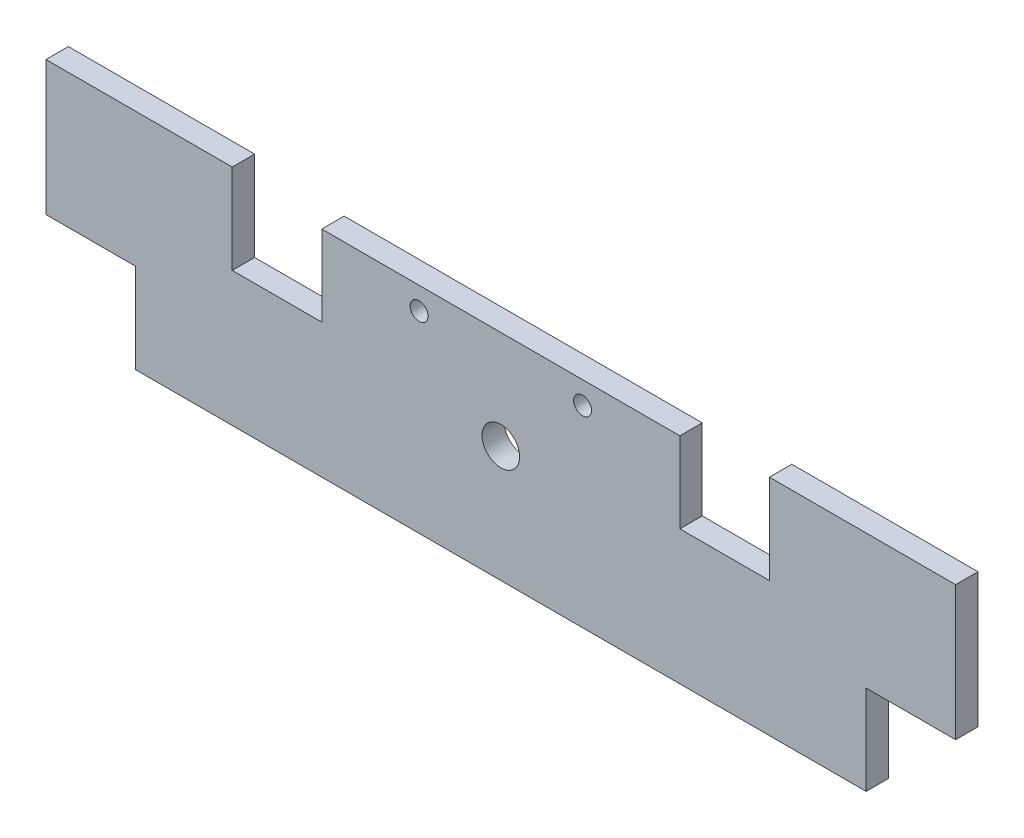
ISO-10303-21;
HEADER;
FILE_DESCRIPTION(('STEP AP214'),'2;1');
FILE_NAME('part.step','',(''),(''),'','','');
FILE_SCHEMA(('AUTOMOTIVE_DESIGN { 1 0 10303 214 1 1 1 1 }'));
ENDSEC;
DATA;
#1=APPLICATION_CONTEXT('core data for automotive mechanical design processes');
#2=APPLICATION_PROTOCOL_DEFINITION('international standard','automotive_design',2000,#1);
#3=PRODUCT_CONTEXT('',#1,'mechanical');
#4=PRODUCT('Part','Part','',(#3));
#5=PRODUCT_RELATED_PRODUCT_CATEGORY('part','',(#4));
#6=PRODUCT_DEFINITION_FORMATION('','',#4);
#7=PRODUCT_DEFINITION_CONTEXT('part definition',#1,'design');
#8=PRODUCT_DEFINITION('design','',#6,#7);
#9=PRODUCT_DEFINITION_SHAPE('','',#8);
#10=(LENGTH_UNIT() NAMED_UNIT(*) SI_UNIT(.MILLI.,.METRE.));
#11=(NAMED_UNIT(*) PLANE_ANGLE_UNIT() SI_UNIT($,.RADIAN.));
#12=(NAMED_UNIT(*) SI_UNIT($,.STERADIAN.) SOLID_ANGLE_UNIT());
#13=UNCERTAINTY_MEASURE_WITH_UNIT(LENGTH_MEASURE(1.E-05),#10,'distance_accuracy_value','');
#14=(GEOMETRIC_REPRESENTATION_CONTEXT(3) GLOBAL_UNCERTAINTY_ASSIGNED_CONTEXT((#13)) GLOBAL_UNIT_ASSIGNED_CONTEXT((#10,
#11,#12)) REPRESENTATION_CONTEXT('',''));
#15=CARTESIAN_POINT('',(0.,0.,0.));
#16=DIRECTION('',(0.,0.,1.));
#17=DIRECTION('',(1.,0.,0.));
#18=AXIS2_PLACEMENT_3D('',#15,#16,#17);
#19=CARTESIAN_POINT('',(-508.,120.,12.5));
#20=DIRECTION('',(0.,-1.,0.));
#21=DIRECTION('',(0.,0.,-1.));
#22=AXIS2_PLACEMENT_3D('',#19,#20,#21);
#23=PLANE('',#22);
#24=DIRECTION('',(-1.,0.,0.));
#25=VECTOR('',#24,1.);
#26=CARTESIAN_POINT('',(-508.,120.,-12.5));
#27=LINE('',#26,#25);
#28=CARTESIAN_POINT('',(508.,120.,-12.5));
#29=VERTEX_POINT('',#28);
#30=CARTESIAN_POINT('',(300.,120.,-12.5));
#31=VERTEX_POINT('',#30);
#32=EDGE_CURVE('E236',#29,#31,#27,.T.);
#33=ORIENTED_EDGE('',*,*,#32,.T.);
#34=DIRECTION('',(0.,0.,1.));
#35=VECTOR('',#34,1.);
#36=CARTESIAN_POINT('',(300.,120.,-12.5));
#37=LINE('',#36,#35);
#38=CARTESIAN_POINT('',(300.,120.,12.5));
#39=VERTEX_POINT('',#38);
#40=EDGE_CURVE('E343',#31,#39,#37,.T.);
#41=ORIENTED_EDGE('',*,*,#40,.T.);
#42=DIRECTION('',(-1.,0.,0.));
#43=VECTOR('',#42,1.);
#44=CARTESIAN_POINT('',(-508.,120.,12.5));
#45=LINE('',#44,#43);
#46=CARTESIAN_POINT('',(508.,120.,12.5));
#47=VERTEX_POINT('',#46);
#48=EDGE_CURVE('E221',#47,#39,#45,.T.);
#49=ORIENTED_EDGE('',*,*,#48,.F.);
#50=DIRECTION('',(0.,0.,-1.));
#51=VECTOR('',#50,1.);
#52=CARTESIAN_POINT('',(508.,120.,12.5));
#53=LINE('',#52,#51);
#54=EDGE_CURVE('E11',#47,#29,#53,.T.);
#55=ORIENTED_EDGE('',*,*,#54,.T.);
#56=EDGE_LOOP('',(#33,#41,#49,#55));
#57=FACE_BOUND('',#56,.T.);
#58=ADVANCED_FACE('F47',(#57),#23,.F.);
#59=CARTESIAN_POINT('',(-300.,120.,12.5));
#60=VERTEX_POINT('',#59);
#61=CARTESIAN_POINT('',(-508.,120.,12.5));
#62=VERTEX_POINT('',#61);
#63=EDGE_CURVE('E219',#60,#62,#45,.T.);
#64=ORIENTED_EDGE('',*,*,#63,.F.);
#65=DIRECTION('',(0.,0.,1.));
#66=VECTOR('',#65,1.);
#67=CARTESIAN_POINT('',(-300.,120.,-12.5));
#68=LINE('',#67,#66);
#69=CARTESIAN_POINT('',(-300.,120.,-12.5));
#70=VERTEX_POINT('',#69);
#71=EDGE_CURVE('E198',#70,#60,#68,.T.);
#72=ORIENTED_EDGE('',*,*,#71,.F.);
#73=CARTESIAN_POINT('',(-508.,120.,-12.5));
#74=VERTEX_POINT('',#73);
#75=EDGE_CURVE('E235',#70,#74,#27,.T.);
#76=ORIENTED_EDGE('',*,*,#75,.T.);
#77=DIRECTION('',(0.,0.,-1.));
#78=VECTOR('',#77,1.);
#79=CARTESIAN_POINT('',(-508.,120.,12.5));
#80=LINE('',#79,#78);
#81=EDGE_CURVE('E56',#62,#74,#80,.T.);
#82=ORIENTED_EDGE('',*,*,#81,.F.);
#83=EDGE_LOOP('',(#64,#72,#76,#82));
#84=FACE_BOUND('',#83,.T.);
#85=ADVANCED_FACE('F397',(#84),#23,.F.);
#86=CARTESIAN_POINT('',(0.,0.,12.5));
#87=DIRECTION('',(0.,0.,-1.));
#88=DIRECTION('',(-1.,0.,0.));
#89=AXIS2_PLACEMENT_3D('',#86,#87,#88);
#90=PLANE('',#89);
#91=CARTESIAN_POINT('',(-91.2970112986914,85.,12.5));
#92=DIRECTION('',(0.,0.,1.));
#93=DIRECTION('',(1.,0.,0.));
#94=AXIS2_PLACEMENT_3D('',#91,#92,#93);
#95=CIRCLE('',#94,9.99999999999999);
#96=CARTESIAN_POINT('',(-81.2970112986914,85.,12.5));
#97=VERTEX_POINT('',#96);
#98=EDGE_CURVE('E381',#97,#97,#95,.T.);
#99=ORIENTED_EDGE('',*,*,#98,.F.);
#100=EDGE_LOOP('',(#99));
#101=FACE_BOUND('',#100,.T.);
#102=CARTESIAN_POINT('',(91.2970112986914,85.,12.5));
#103=DIRECTION('',(0.,0.,1.));
#104=DIRECTION('',(1.,0.,0.));
#105=AXIS2_PLACEMENT_3D('',#102,#103,#104);
#106=CIRCLE('',#105,9.99999999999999);
#107=CARTESIAN_POINT('',(101.297011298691,85.,12.5));
#108=VERTEX_POINT('',#107);
#109=EDGE_CURVE('E377',#108,#108,#106,.T.);
#110=ORIENTED_EDGE('',*,*,#109,.F.);
#111=EDGE_LOOP('',(#110));
#112=FACE_BOUND('',#111,.T.);
#113=DIRECTION('',(0.,-1.,0.));
#114=VECTOR('',#113,1.);
#115=CARTESIAN_POINT('',(200.,120.,12.5));
#116=LINE('',#115,#114);
#117=CARTESIAN_POINT('',(200.,110.,12.5));
#118=VERTEX_POINT('',#117);
#119=CARTESIAN_POINT('',(200.,20.,12.5));
#120=VERTEX_POINT('',#119);
#121=EDGE_CURVE('E178',#118,#120,#116,.T.);
#122=ORIENTED_EDGE('',*,*,#121,.F.);
#123=DIRECTION('',(1.,0.,0.));
#124=VECTOR('',#123,1.);
#125=CARTESIAN_POINT('',(-200.,110.,12.5));
#126=LINE('',#125,#124);
#127=CARTESIAN_POINT('',(-200.,110.,12.5));
#128=VERTEX_POINT('',#127);
#129=EDGE_CURVE('E63',#128,#118,#126,.T.);
#130=ORIENTED_EDGE('',*,*,#129,.F.);
#131=DIRECTION('',(0.,1.,0.));
#132=VECTOR('',#131,1.);
#133=CARTESIAN_POINT('',(-200.,120.,12.5));
#134=LINE('',#133,#132);
#135=CARTESIAN_POINT('',(-200.,20.,12.5));
#136=VERTEX_POINT('',#135);
#137=EDGE_CURVE('E176',#136,#128,#134,.T.);
#138=ORIENTED_EDGE('',*,*,#137,.F.);
#139=DIRECTION('',(1.,0.,0.));
#140=VECTOR('',#139,1.);
#141=CARTESIAN_POINT('',(-300.,20.,12.5));
#142=LINE('',#141,#140);
#143=CARTESIAN_POINT('',(-300.,20.,12.5));
#144=VERTEX_POINT('',#143);
#145=EDGE_CURVE('E187',#144,#136,#142,.T.);
#146=ORIENTED_EDGE('',*,*,#145,.F.);
#147=DIRECTION('',(0.,-1.,0.));
#148=VECTOR('',#147,1.);
#149=CARTESIAN_POINT('',(-300.,120.,12.5));
#150=LINE('',#149,#148);
#151=EDGE_CURVE('E194',#60,#144,#150,.T.);
#152=ORIENTED_EDGE('',*,*,#151,.F.);
#153=ORIENTED_EDGE('',*,*,#63,.T.);
#154=DIRECTION('',(0.,-1.,0.));
#155=VECTOR('',#154,1.);
#156=CARTESIAN_POINT('',(-508.,120.,12.5));
#157=LINE('',#156,#155);
#158=CARTESIAN_POINT('',(-508.,-30.0000000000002,12.5));
#159=VERTEX_POINT('',#158);
#160=EDGE_CURVE('E225',#62,#159,#157,.T.);
#161=ORIENTED_EDGE('',*,*,#160,.T.);
#162=DIRECTION('',(-1.,0.,0.));
#163=VECTOR('',#162,1.);
#164=CARTESIAN_POINT('',(-508.,-30.0000000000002,12.5));
#165=LINE('',#164,#163);
#166=CARTESIAN_POINT('',(-408.,-30.0000000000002,12.5));
#167=VERTEX_POINT('',#166);
#168=EDGE_CURVE('E272',#167,#159,#165,.T.);
#169=ORIENTED_EDGE('',*,*,#168,.F.);
#170=DIRECTION('',(0.,1.,0.));
#171=VECTOR('',#170,1.);
#172=CARTESIAN_POINT('',(-408.,-130.,12.5));
#173=LINE('',#172,#171);
#174=CARTESIAN_POINT('',(-408.,-130.,12.5));
#175=VERTEX_POINT('',#174);
#176=EDGE_CURVE('E277',#175,#167,#173,.T.);
#177=ORIENTED_EDGE('',*,*,#176,.F.);
#178=DIRECTION('',(1.,0.,0.));
#179=VECTOR('',#178,1.);
#180=CARTESIAN_POINT('',(508.,-130.,12.5));
#181=LINE('',#180,#179);
#182=CARTESIAN_POINT('',(408.,-130.,12.5));
#183=VERTEX_POINT('',#182);
#184=EDGE_CURVE('E229',#175,#183,#181,.T.);
#185=ORIENTED_EDGE('',*,*,#184,.T.);
#186=DIRECTION('',(0.,-1.,0.));
#187=VECTOR('',#186,1.);
#188=CARTESIAN_POINT('',(408.,-130.,12.5));
#189=LINE('',#188,#187);
#190=CARTESIAN_POINT('',(408.,-30.0000000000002,12.5));
#191=VERTEX_POINT('',#190);
#192=EDGE_CURVE('E71',#191,#183,#189,.T.);
#193=ORIENTED_EDGE('',*,*,#192,.F.);
#194=DIRECTION('',(-1.,0.,0.));
#195=VECTOR('',#194,1.);
#196=CARTESIAN_POINT('',(508.,-30.0000000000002,12.5));
#197=LINE('',#196,#195);
#198=CARTESIAN_POINT('',(508.,-30.0000000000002,12.5));
#199=VERTEX_POINT('',#198);
#200=EDGE_CURVE('E292',#199,#191,#197,.T.);
#201=ORIENTED_EDGE('',*,*,#200,.F.);
#202=DIRECTION('',(0.,1.,0.));
#203=VECTOR('',#202,1.);
#204=CARTESIAN_POINT('',(508.,120.,12.5));
#205=LINE('',#204,#203);
#206=EDGE_CURVE('E216',#199,#47,#205,.T.);
#207=ORIENTED_EDGE('',*,*,#206,.T.);
#208=ORIENTED_EDGE('',*,*,#48,.T.);
#209=DIRECTION('',(0.,1.,0.));
#210=VECTOR('',#209,1.);
#211=CARTESIAN_POINT('',(300.,120.,12.5));
#212=LINE('',#211,#210);
#213=CARTESIAN_POINT('',(300.,20.,12.5));
#214=VERTEX_POINT('',#213);
#215=EDGE_CURVE('E320',#214,#39,#212,.T.);
#216=ORIENTED_EDGE('',*,*,#215,.F.);
#217=DIRECTION('',(1.,0.,0.));
#218=VECTOR('',#217,1.);
#219=CARTESIAN_POINT('',(300.,20.,12.5));
#220=LINE('',#219,#218);
#221=EDGE_CURVE('E313',#120,#214,#220,.T.);
#222=ORIENTED_EDGE('',*,*,#221,.F.);
#223=EDGE_LOOP('',(#122,#130,#138,#146,#152,#153,#161,#169,#177,#185,#193,#201,#207,#208,#216,#222));
#224=FACE_BOUND('',#223,.T.);
#225=CARTESIAN_POINT('',(0.,0.,12.5));
#226=DIRECTION('',(0.,0.,1.));
#227=DIRECTION('',(1.,0.,0.));
#228=AXIS2_PLACEMENT_3D('',#225,#226,#227);
#229=CIRCLE('',#228,21.);
#230=CARTESIAN_POINT('',(21.,0.,12.5));
#231=VERTEX_POINT('',#230);
#232=EDGE_CURVE('E208',#231,#231,#229,.T.);
#233=ORIENTED_EDGE('',*,*,#232,.F.);
#234=EDGE_LOOP('',(#233));
#235=FACE_BOUND('',#234,.T.);
#236=ADVANCED_FACE('F173',(#101,#112,#224,#235),#90,.F.);
#237=CARTESIAN_POINT('',(0.,0.,-12.5));
#238=DIRECTION('',(0.,0.,-1.));
#239=DIRECTION('',(-1.,0.,0.));
#240=AXIS2_PLACEMENT_3D('',#237,#238,#239);
#241=PLANE('',#240);
#242=CARTESIAN_POINT('',(-91.2970112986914,85.,-12.5));
#243=DIRECTION('',(0.,0.,1.));
#244=DIRECTION('',(1.,0.,0.));
#245=AXIS2_PLACEMENT_3D('',#242,#243,#244);
#246=CIRCLE('',#245,9.99999999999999);
#247=CARTESIAN_POINT('',(-81.2970112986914,85.,-12.5));
#248=VERTEX_POINT('',#247);
#249=EDGE_CURVE('E180',#248,#248,#246,.T.);
#250=ORIENTED_EDGE('',*,*,#249,.T.);
#251=EDGE_LOOP('',(#250));
#252=FACE_BOUND('',#251,.T.);
#253=CARTESIAN_POINT('',(91.2970112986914,85.,-12.5));
#254=DIRECTION('',(0.,0.,1.));
#255=DIRECTION('',(1.,0.,0.));
#256=AXIS2_PLACEMENT_3D('',#253,#254,#255);
#257=CIRCLE('',#256,9.99999999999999);
#258=CARTESIAN_POINT('',(101.297011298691,85.,-12.5));
#259=VERTEX_POINT('',#258);
#260=EDGE_CURVE('E382',#259,#259,#257,.T.);
#261=ORIENTED_EDGE('',*,*,#260,.T.);
#262=EDGE_LOOP('',(#261));
#263=FACE_BOUND('',#262,.T.);
#264=DIRECTION('',(1.,0.,0.));
#265=VECTOR('',#264,1.);
#266=CARTESIAN_POINT('',(-200.,110.,-12.5));
#267=LINE('',#266,#265);
#268=CARTESIAN_POINT('',(-200.,110.,-12.5));
#269=VERTEX_POINT('',#268);
#270=CARTESIAN_POINT('',(200.,110.,-12.5));
#271=VERTEX_POINT('',#270);
#272=EDGE_CURVE('E162',#269,#271,#267,.T.);
#273=ORIENTED_EDGE('',*,*,#272,.T.);
#274=DIRECTION('',(0.,-1.,0.));
#275=VECTOR('',#274,1.);
#276=CARTESIAN_POINT('',(200.,120.,-12.5));
#277=LINE('',#276,#275);
#278=CARTESIAN_POINT('',(200.,20.,-12.5));
#279=VERTEX_POINT('',#278);
#280=EDGE_CURVE('E333',#271,#279,#277,.T.);
#281=ORIENTED_EDGE('',*,*,#280,.T.);
#282=DIRECTION('',(1.,0.,0.));
#283=VECTOR('',#282,1.);
#284=CARTESIAN_POINT('',(300.,20.,-12.5));
#285=LINE('',#284,#283);
#286=CARTESIAN_POINT('',(300.,20.,-12.5));
#287=VERTEX_POINT('',#286);
#288=EDGE_CURVE('E328',#279,#287,#285,.T.);
#289=ORIENTED_EDGE('',*,*,#288,.T.);
#290=DIRECTION('',(0.,1.,0.));
#291=VECTOR('',#290,1.);
#292=CARTESIAN_POINT('',(300.,120.,-12.5));
#293=LINE('',#292,#291);
#294=EDGE_CURVE('E324',#287,#31,#293,.T.);
#295=ORIENTED_EDGE('',*,*,#294,.T.);
#296=ORIENTED_EDGE('',*,*,#32,.F.);
#297=DIRECTION('',(0.,1.,0.));
#298=VECTOR('',#297,1.);
#299=CARTESIAN_POINT('',(508.,120.,-12.5));
#300=LINE('',#299,#298);
#301=CARTESIAN_POINT('',(508.,-30.0000000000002,-12.5));
#302=VERTEX_POINT('',#301);
#303=EDGE_CURVE('E212',#302,#29,#300,.T.);
#304=ORIENTED_EDGE('',*,*,#303,.F.);
#305=DIRECTION('',(-1.,0.,0.));
#306=VECTOR('',#305,1.);
#307=CARTESIAN_POINT('',(508.,-30.0000000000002,-12.5));
#308=LINE('',#307,#306);
#309=CARTESIAN_POINT('',(408.,-30.0000000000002,-12.5));
#310=VERTEX_POINT('',#309);
#311=EDGE_CURVE('E293',#302,#310,#308,.T.);
#312=ORIENTED_EDGE('',*,*,#311,.T.);
#313=DIRECTION('',(0.,-1.,0.));
#314=VECTOR('',#313,1.);
#315=CARTESIAN_POINT('',(408.,-130.,-12.5));
#316=LINE('',#315,#314);
#317=CARTESIAN_POINT('',(408.,-130.,-12.5));
#318=VERTEX_POINT('',#317);
#319=EDGE_CURVE('E283',#310,#318,#316,.T.);
#320=ORIENTED_EDGE('',*,*,#319,.T.);
#321=DIRECTION('',(1.,0.,0.));
#322=VECTOR('',#321,1.);
#323=CARTESIAN_POINT('',(508.,-130.,-12.5));
#324=LINE('',#323,#322);
#325=CARTESIAN_POINT('',(-408.,-130.,-12.5));
#326=VERTEX_POINT('',#325);
#327=EDGE_CURVE('E220',#326,#318,#324,.T.);
#328=ORIENTED_EDGE('',*,*,#327,.F.);
#329=DIRECTION('',(0.,1.,0.));
#330=VECTOR('',#329,1.);
#331=CARTESIAN_POINT('',(-408.,-130.,-12.5));
#332=LINE('',#331,#330);
#333=CARTESIAN_POINT('',(-408.,-30.0000000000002,-12.5));
#334=VERTEX_POINT('',#333);
#335=EDGE_CURVE('E265',#326,#334,#332,.T.);
#336=ORIENTED_EDGE('',*,*,#335,.T.);
#337=DIRECTION('',(-1.,0.,0.));
#338=VECTOR('',#337,1.);
#339=CARTESIAN_POINT('',(-508.,-30.0000000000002,-12.5));
#340=LINE('',#339,#338);
#341=CARTESIAN_POINT('',(-508.,-30.0000000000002,-12.5));
#342=VERTEX_POINT('',#341);
#343=EDGE_CURVE('E263',#334,#342,#340,.T.);
#344=ORIENTED_EDGE('',*,*,#343,.T.);
#345=DIRECTION('',(0.,-1.,0.));
#346=VECTOR('',#345,1.);
#347=CARTESIAN_POINT('',(-508.,120.,-12.5));
#348=LINE('',#347,#346);
#349=EDGE_CURVE('E240',#74,#342,#348,.T.);
#350=ORIENTED_EDGE('',*,*,#349,.F.);
#351=ORIENTED_EDGE('',*,*,#75,.F.);
#352=DIRECTION('',(0.,-1.,0.));
#353=VECTOR('',#352,1.);
#354=CARTESIAN_POINT('',(-300.,120.,-12.5));
#355=LINE('',#354,#353);
#356=CARTESIAN_POINT('',(-300.,20.,-12.5));
#357=VERTEX_POINT('',#356);
#358=EDGE_CURVE('E186',#70,#357,#355,.T.);
#359=ORIENTED_EDGE('',*,*,#358,.T.);
#360=DIRECTION('',(1.,0.,0.));
#361=VECTOR('',#360,1.);
#362=CARTESIAN_POINT('',(-300.,20.,-12.5));
#363=LINE('',#362,#361);
#364=CARTESIAN_POINT('',(-200.,20.,-12.5));
#365=VERTEX_POINT('',#364);
#366=EDGE_CURVE('E192',#357,#365,#363,.T.);
#367=ORIENTED_EDGE('',*,*,#366,.T.);
#368=DIRECTION('',(0.,1.,0.));
#369=VECTOR('',#368,1.);
#370=CARTESIAN_POINT('',(-200.,120.,-12.5));
#371=LINE('',#370,#369);
#372=EDGE_CURVE('E207',#365,#269,#371,.T.);
#373=ORIENTED_EDGE('',*,*,#372,.T.);
#374=EDGE_LOOP('',(#273,#281,#289,#295,#296,#304,#312,#320,#328,#336,#344,#350,#351,#359,#367,#373));
#375=FACE_BOUND('',#374,.T.);
#376=CARTESIAN_POINT('',(0.,0.,-12.5));
#377=DIRECTION('',(0.,0.,1.));
#378=DIRECTION('',(1.,0.,0.));
#379=AXIS2_PLACEMENT_3D('',#376,#377,#378);
#380=CIRCLE('',#379,21.);
#381=CARTESIAN_POINT('',(21.,0.,-12.5));
#382=VERTEX_POINT('',#381);
#383=EDGE_CURVE('E201',#382,#382,#380,.T.);
#384=ORIENTED_EDGE('',*,*,#383,.T.);
#385=EDGE_LOOP('',(#384));
#386=FACE_BOUND('',#385,.T.);
#387=ADVANCED_FACE('F259',(#252,#263,#375,#386),#241,.T.);
#388=CARTESIAN_POINT('',(508.,120.,12.5));
#389=DIRECTION('',(-1.,0.,0.));
#390=DIRECTION('',(0.,0.,1.));
#391=AXIS2_PLACEMENT_3D('',#388,#389,#390);
#392=PLANE('',#391);
#393=ORIENTED_EDGE('',*,*,#206,.F.);
#394=DIRECTION('',(0.,0.,1.));
#395=VECTOR('',#394,1.);
#396=CARTESIAN_POINT('',(508.,-30.0000000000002,-12.5));
#397=LINE('',#396,#395);
#398=EDGE_CURVE('E280',#302,#199,#397,.T.);
#399=ORIENTED_EDGE('',*,*,#398,.F.);
#400=ORIENTED_EDGE('',*,*,#303,.T.);
#401=ORIENTED_EDGE('',*,*,#54,.F.);
#402=EDGE_LOOP('',(#393,#399,#400,#401));
#403=FACE_BOUND('',#402,.T.);
#404=ADVANCED_FACE('F49',(#403),#392,.F.);
#405=CARTESIAN_POINT('',(-508.,120.,12.5));
#406=DIRECTION('',(1.,0.,0.));
#407=DIRECTION('',(0.,0.,-1.));
#408=AXIS2_PLACEMENT_3D('',#405,#406,#407);
#409=PLANE('',#408);
#410=ORIENTED_EDGE('',*,*,#349,.T.);
#411=DIRECTION('',(0.,0.,1.));
#412=VECTOR('',#411,1.);
#413=CARTESIAN_POINT('',(-508.,-30.0000000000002,-12.5));
#414=LINE('',#413,#412);
#415=EDGE_CURVE('E297',#342,#159,#414,.T.);
#416=ORIENTED_EDGE('',*,*,#415,.T.);
#417=ORIENTED_EDGE('',*,*,#160,.F.);
#418=ORIENTED_EDGE('',*,*,#81,.T.);
#419=EDGE_LOOP('',(#410,#416,#417,#418));
#420=FACE_BOUND('',#419,.T.);
#421=ADVANCED_FACE('F252',(#420),#409,.F.);
#422=CARTESIAN_POINT('',(508.,-130.,12.5));
#423=DIRECTION('',(0.,1.,0.));
#424=DIRECTION('',(0.,0.,1.));
#425=AXIS2_PLACEMENT_3D('',#422,#423,#424);
#426=PLANE('',#425);
#427=ORIENTED_EDGE('',*,*,#327,.T.);
#428=DIRECTION('',(0.,0.,1.));
#429=VECTOR('',#428,1.);
#430=CARTESIAN_POINT('',(408.,-130.,-12.5));
#431=LINE('',#430,#429);
#432=EDGE_CURVE('E287',#318,#183,#431,.T.);
#433=ORIENTED_EDGE('',*,*,#432,.T.);
#434=ORIENTED_EDGE('',*,*,#184,.F.);
#435=DIRECTION('',(0.,0.,1.));
#436=VECTOR('',#435,1.);
#437=CARTESIAN_POINT('',(-408.,-130.,-12.5));
#438=LINE('',#437,#436);
#439=EDGE_CURVE('E268',#326,#175,#438,.T.);
#440=ORIENTED_EDGE('',*,*,#439,.F.);
#441=EDGE_LOOP('',(#427,#433,#434,#440));
#442=FACE_BOUND('',#441,.T.);
#443=ADVANCED_FACE('F423',(#442),#426,.F.);
#444=CARTESIAN_POINT('',(0.,0.,12.5));
#445=DIRECTION('',(0.,0.,-1.));
#446=DIRECTION('',(-1.,0.,0.));
#447=AXIS2_PLACEMENT_3D('',#444,#445,#446);
#448=CYLINDRICAL_SURFACE('',#447,21.);
#449=ORIENTED_EDGE('',*,*,#232,.T.);
#450=EDGE_LOOP('',(#449));
#451=FACE_BOUND('',#450,.T.);
#452=ORIENTED_EDGE('',*,*,#383,.F.);
#453=EDGE_LOOP('',(#452));
#454=FACE_BOUND('',#453,.T.);
#455=ADVANCED_FACE('F426',(#451,#454),#448,.F.);
#456=CARTESIAN_POINT('',(-508.,-30.0000000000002,-12.5));
#457=DIRECTION('',(0.,1.,0.));
#458=DIRECTION('',(0.,0.,1.));
#459=AXIS2_PLACEMENT_3D('',#456,#457,#458);
#460=PLANE('',#459);
#461=ORIENTED_EDGE('',*,*,#168,.T.);
#462=ORIENTED_EDGE('',*,*,#415,.F.);
#463=ORIENTED_EDGE('',*,*,#343,.F.);
#464=DIRECTION('',(0.,0.,1.));
#465=VECTOR('',#464,1.);
#466=CARTESIAN_POINT('',(-408.,-30.0000000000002,-12.5));
#467=LINE('',#466,#465);
#468=EDGE_CURVE('E274',#334,#167,#467,.T.);
#469=ORIENTED_EDGE('',*,*,#468,.T.);
#470=EDGE_LOOP('',(#461,#462,#463,#469));
#471=FACE_BOUND('',#470,.T.);
#472=ADVANCED_FACE('F431',(#471),#460,.F.);
#473=CARTESIAN_POINT('',(-408.,-130.,-12.5));
#474=DIRECTION('',(1.,0.,0.));
#475=DIRECTION('',(0.,0.,-1.));
#476=AXIS2_PLACEMENT_3D('',#473,#474,#475);
#477=PLANE('',#476);
#478=ORIENTED_EDGE('',*,*,#176,.T.);
#479=ORIENTED_EDGE('',*,*,#468,.F.);
#480=ORIENTED_EDGE('',*,*,#335,.F.);
#481=ORIENTED_EDGE('',*,*,#439,.T.);
#482=EDGE_LOOP('',(#478,#479,#480,#481));
#483=FACE_BOUND('',#482,.T.);
#484=ADVANCED_FACE('F446',(#483),#477,.F.);
#485=CARTESIAN_POINT('',(408.,-130.,-12.5));
#486=DIRECTION('',(-1.,0.,0.));
#487=DIRECTION('',(0.,0.,1.));
#488=AXIS2_PLACEMENT_3D('',#485,#486,#487);
#489=PLANE('',#488);
#490=ORIENTED_EDGE('',*,*,#192,.T.);
#491=ORIENTED_EDGE('',*,*,#432,.F.);
#492=ORIENTED_EDGE('',*,*,#319,.F.);
#493=DIRECTION('',(0.,0.,1.));
#494=VECTOR('',#493,1.);
#495=CARTESIAN_POINT('',(408.,-30.0000000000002,-12.5));
#496=LINE('',#495,#494);
#497=EDGE_CURVE('E284',#310,#191,#496,.T.);
#498=ORIENTED_EDGE('',*,*,#497,.T.);
#499=EDGE_LOOP('',(#490,#491,#492,#498));
#500=FACE_BOUND('',#499,.T.);
#501=ADVANCED_FACE('F443',(#500),#489,.F.);
#502=CARTESIAN_POINT('',(508.,-30.0000000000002,-12.5));
#503=DIRECTION('',(0.,1.,0.));
#504=DIRECTION('',(0.,0.,1.));
#505=AXIS2_PLACEMENT_3D('',#502,#503,#504);
#506=PLANE('',#505);
#507=ORIENTED_EDGE('',*,*,#200,.T.);
#508=ORIENTED_EDGE('',*,*,#497,.F.);
#509=ORIENTED_EDGE('',*,*,#311,.F.);
#510=ORIENTED_EDGE('',*,*,#398,.T.);
#511=EDGE_LOOP('',(#507,#508,#509,#510));
#512=FACE_BOUND('',#511,.T.);
#513=ADVANCED_FACE('F436',(#512),#506,.F.);
#514=CARTESIAN_POINT('',(-300.,120.,-12.5));
#515=DIRECTION('',(-1.,0.,0.));
#516=DIRECTION('',(0.,0.,1.));
#517=AXIS2_PLACEMENT_3D('',#514,#515,#516);
#518=PLANE('',#517);
#519=ORIENTED_EDGE('',*,*,#151,.T.);
#520=DIRECTION('',(0.,0.,1.));
#521=VECTOR('',#520,1.);
#522=CARTESIAN_POINT('',(-300.,20.,-12.5));
#523=LINE('',#522,#521);
#524=EDGE_CURVE('E204',#357,#144,#523,.T.);
#525=ORIENTED_EDGE('',*,*,#524,.F.);
#526=ORIENTED_EDGE('',*,*,#358,.F.);
#527=ORIENTED_EDGE('',*,*,#71,.T.);
#528=EDGE_LOOP('',(#519,#525,#526,#527));
#529=FACE_BOUND('',#528,.T.);
#530=ADVANCED_FACE('F433',(#529),#518,.F.);
#531=CARTESIAN_POINT('',(-200.,120.,-12.5));
#532=DIRECTION('',(1.,0.,0.));
#533=DIRECTION('',(0.,1.,0.));
#534=AXIS2_PLACEMENT_3D('',#531,#532,#533);
#535=PLANE('',#534);
#536=ORIENTED_EDGE('',*,*,#137,.T.);
#537=DIRECTION('',(0.,0.,1.));
#538=VECTOR('',#537,1.);
#539=CARTESIAN_POINT('',(-200.,110.,-12.5));
#540=LINE('',#539,#538);
#541=EDGE_CURVE('E159',#269,#128,#540,.T.);
#542=ORIENTED_EDGE('',*,*,#541,.F.);
#543=ORIENTED_EDGE('',*,*,#372,.F.);
#544=DIRECTION('',(0.,0.,1.));
#545=VECTOR('',#544,1.);
#546=CARTESIAN_POINT('',(-200.,20.,-12.5));
#547=LINE('',#546,#545);
#548=EDGE_CURVE('E183',#365,#136,#547,.T.);
#549=ORIENTED_EDGE('',*,*,#548,.T.);
#550=EDGE_LOOP('',(#536,#542,#543,#549));
#551=FACE_BOUND('',#550,.T.);
#552=ADVANCED_FACE('F182',(#551),#535,.F.);
#553=CARTESIAN_POINT('',(-300.,20.,-12.5));
#554=DIRECTION('',(0.,-1.,0.));
#555=DIRECTION('',(0.,0.,-1.));
#556=AXIS2_PLACEMENT_3D('',#553,#554,#555);
#557=PLANE('',#556);
#558=ORIENTED_EDGE('',*,*,#145,.T.);
#559=ORIENTED_EDGE('',*,*,#548,.F.);
#560=ORIENTED_EDGE('',*,*,#366,.F.);
#561=ORIENTED_EDGE('',*,*,#524,.T.);
#562=EDGE_LOOP('',(#558,#559,#560,#561));
#563=FACE_BOUND('',#562,.T.);
#564=ADVANCED_FACE('F437',(#563),#557,.F.);
#565=CARTESIAN_POINT('',(300.,120.,-12.5));
#566=DIRECTION('',(1.,0.,0.));
#567=DIRECTION('',(0.,0.,-1.));
#568=AXIS2_PLACEMENT_3D('',#565,#566,#567);
#569=PLANE('',#568);
#570=ORIENTED_EDGE('',*,*,#215,.T.);
#571=ORIENTED_EDGE('',*,*,#40,.F.);
#572=ORIENTED_EDGE('',*,*,#294,.F.);
#573=DIRECTION('',(0.,0.,1.));
#574=VECTOR('',#573,1.);
#575=CARTESIAN_POINT('',(300.,20.,-12.5));
#576=LINE('',#575,#574);
#577=EDGE_CURVE('E348',#287,#214,#576,.T.);
#578=ORIENTED_EDGE('',*,*,#577,.T.);
#579=EDGE_LOOP('',(#570,#571,#572,#578));
#580=FACE_BOUND('',#579,.T.);
#581=ADVANCED_FACE('F358',(#580),#569,.F.);
#582=CARTESIAN_POINT('',(300.,20.,-12.5));
#583=DIRECTION('',(0.,-1.,0.));
#584=DIRECTION('',(0.,0.,-1.));
#585=AXIS2_PLACEMENT_3D('',#582,#583,#584);
#586=PLANE('',#585);
#587=ORIENTED_EDGE('',*,*,#221,.T.);
#588=ORIENTED_EDGE('',*,*,#577,.F.);
#589=ORIENTED_EDGE('',*,*,#288,.F.);
#590=DIRECTION('',(0.,0.,1.));
#591=VECTOR('',#590,1.);
#592=CARTESIAN_POINT('',(200.,20.,-12.5));
#593=LINE('',#592,#591);
#594=EDGE_CURVE('E329',#279,#120,#593,.T.);
#595=ORIENTED_EDGE('',*,*,#594,.T.);
#596=EDGE_LOOP('',(#587,#588,#589,#595));
#597=FACE_BOUND('',#596,.T.);
#598=ADVANCED_FACE('F370',(#597),#586,.F.);
#599=CARTESIAN_POINT('',(200.,120.,-12.5));
#600=DIRECTION('',(-1.,0.,0.));
#601=DIRECTION('',(0.,-1.,0.));
#602=AXIS2_PLACEMENT_3D('',#599,#600,#601);
#603=PLANE('',#602);
#604=ORIENTED_EDGE('',*,*,#280,.F.);
#605=DIRECTION('',(0.,0.,1.));
#606=VECTOR('',#605,1.);
#607=CARTESIAN_POINT('',(200.,110.,-12.5));
#608=LINE('',#607,#606);
#609=EDGE_CURVE('E168',#271,#118,#608,.T.);
#610=ORIENTED_EDGE('',*,*,#609,.T.);
#611=ORIENTED_EDGE('',*,*,#121,.T.);
#612=ORIENTED_EDGE('',*,*,#594,.F.);
#613=EDGE_LOOP('',(#604,#610,#611,#612));
#614=FACE_BOUND('',#613,.T.);
#615=ADVANCED_FACE('F412',(#614),#603,.F.);
#616=CARTESIAN_POINT('',(-200.,110.,-12.5));
#617=DIRECTION('',(0.,-1.,0.));
#618=DIRECTION('',(0.,0.,-1.));
#619=AXIS2_PLACEMENT_3D('',#616,#617,#618);
#620=PLANE('',#619);
#621=ORIENTED_EDGE('',*,*,#609,.F.);
#622=ORIENTED_EDGE('',*,*,#272,.F.);
#623=ORIENTED_EDGE('',*,*,#541,.T.);
#624=ORIENTED_EDGE('',*,*,#129,.T.);
#625=EDGE_LOOP('',(#621,#622,#623,#624));
#626=FACE_BOUND('',#625,.T.);
#627=ADVANCED_FACE('F160',(#626),#620,.F.);
#628=CARTESIAN_POINT('',(91.2970112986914,85.,-12.5));
#629=DIRECTION('',(0.,0.,1.));
#630=DIRECTION('',(1.,0.,0.));
#631=AXIS2_PLACEMENT_3D('',#628,#629,#630);
#632=CYLINDRICAL_SURFACE('',#631,9.99999999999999);
#633=ORIENTED_EDGE('',*,*,#260,.F.);
#634=EDGE_LOOP('',(#633));
#635=FACE_BOUND('',#634,.T.);
#636=ORIENTED_EDGE('',*,*,#109,.T.);
#637=EDGE_LOOP('',(#636));
#638=FACE_BOUND('',#637,.T.);
#639=ADVANCED_FACE('F401',(#635,#638),#632,.F.);
#640=CARTESIAN_POINT('',(-91.2970112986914,85.,-12.5));
#641=DIRECTION('',(0.,0.,1.));
#642=DIRECTION('',(1.,0.,0.));
#643=AXIS2_PLACEMENT_3D('',#640,#641,#642);
#644=CYLINDRICAL_SURFACE('',#643,9.99999999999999);
#645=ORIENTED_EDGE('',*,*,#249,.F.);
#646=EDGE_LOOP('',(#645));
#647=FACE_BOUND('',#646,.T.);
#648=ORIENTED_EDGE('',*,*,#98,.T.);
#649=EDGE_LOOP('',(#648));
#650=FACE_BOUND('',#649,.T.);
#651=ADVANCED_FACE('F393',(#647,#650),#644,.F.);
#652=CLOSED_SHELL('',(#58,#85,#236,#387,#404,#421,#443,#455,#472,#484,#501,#513,#530,#552,#564,
#581,#598,#615,#627,#639,#651));
#653=MANIFOLD_SOLID_BREP('B2',#652);
#654=ADVANCED_BREP_SHAPE_REPRESENTATION('',(#18,#653),#14);
#655=SHAPE_DEFINITION_REPRESENTATION(#9,#654);
ENDSEC;
END-ISO-10303-21;
